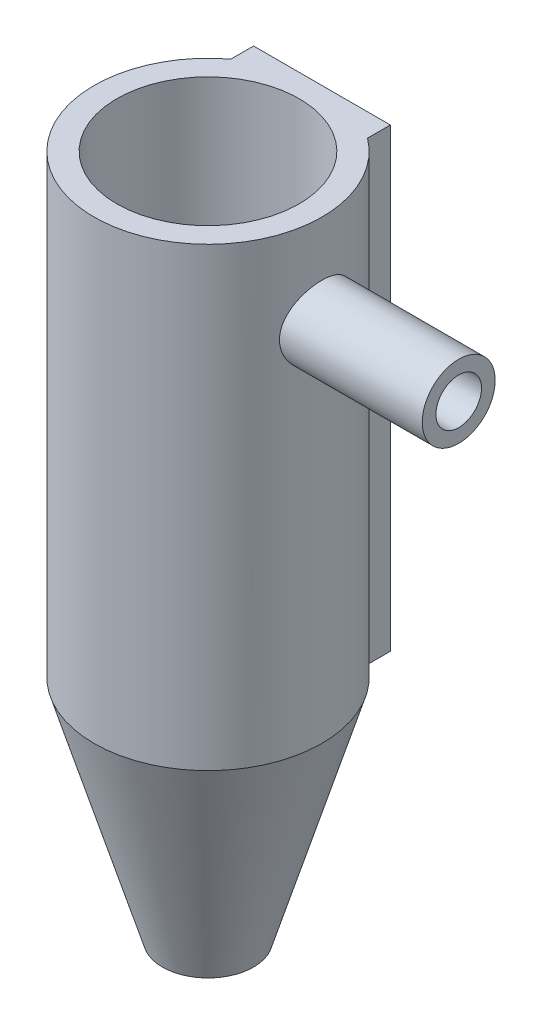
ISO-10303-21;
HEADER;
FILE_DESCRIPTION(('STEP AP214'),'2;1');
FILE_NAME('part.step','',(''),(''),'','','');
FILE_SCHEMA(('AUTOMOTIVE_DESIGN { 1 0 10303 214 1 1 1 1 }'));
ENDSEC;
DATA;
#1=APPLICATION_CONTEXT('core data for automotive mechanical design processes');
#2=APPLICATION_PROTOCOL_DEFINITION('international standard','automotive_design',2000,#1);
#3=PRODUCT_CONTEXT('',#1,'mechanical');
#4=PRODUCT('Part','Part','',(#3));
#5=PRODUCT_RELATED_PRODUCT_CATEGORY('part','',(#4));
#6=PRODUCT_DEFINITION_FORMATION('','',#4);
#7=PRODUCT_DEFINITION_CONTEXT('part definition',#1,'design');
#8=PRODUCT_DEFINITION('design','',#6,#7);
#9=PRODUCT_DEFINITION_SHAPE('','',#8);
#10=(LENGTH_UNIT() NAMED_UNIT(*) SI_UNIT(.MILLI.,.METRE.));
#11=(NAMED_UNIT(*) PLANE_ANGLE_UNIT() SI_UNIT($,.RADIAN.));
#12=(NAMED_UNIT(*) SI_UNIT($,.STERADIAN.) SOLID_ANGLE_UNIT());
#13=UNCERTAINTY_MEASURE_WITH_UNIT(LENGTH_MEASURE(1.E-05),#10,'distance_accuracy_value','');
#14=(GEOMETRIC_REPRESENTATION_CONTEXT(3) GLOBAL_UNCERTAINTY_ASSIGNED_CONTEXT((#13)) GLOBAL_UNIT_ASSIGNED_CONTEXT((#10,
#11,#12)) REPRESENTATION_CONTEXT('',''));
#15=CARTESIAN_POINT('',(0.,0.,0.));
#16=DIRECTION('',(0.,0.,1.));
#17=DIRECTION('',(1.,0.,0.));
#18=AXIS2_PLACEMENT_3D('',#15,#16,#17);
#19=CARTESIAN_POINT('',(0.,150.,0.));
#20=DIRECTION('',(0.,-1.,0.));
#21=DIRECTION('',(0.,0.,-1.));
#22=AXIS2_PLACEMENT_3D('',#19,#20,#21);
#23=CYLINDRICAL_SURFACE('',#22,25.);
#24=CARTESIAN_POINT('',(0.,150.,0.));
#25=DIRECTION('',(0.,1.,0.));
#26=DIRECTION('',(0.,0.,1.));
#27=AXIS2_PLACEMENT_3D('',#24,#25,#26);
#28=CIRCLE('',#27,25.);
#29=CARTESIAN_POINT('',(-15.,150.,-20.));
#30=VERTEX_POINT('',#29);
#31=CARTESIAN_POINT('',(15.,150.,-20.));
#32=VERTEX_POINT('',#31);
#33=EDGE_CURVE('E57',#30,#32,#28,.T.);
#34=ORIENTED_EDGE('',*,*,#33,.F.);
#35=DIRECTION('',(0.,-1.,0.));
#36=VECTOR('',#35,1.);
#37=CARTESIAN_POINT('',(-15.,150.,-20.));
#38=LINE('',#37,#36);
#39=CARTESIAN_POINT('',(-15.,50.,-20.));
#40=VERTEX_POINT('',#39);
#41=EDGE_CURVE('E151',#40,#30,#38,.F.);
#42=ORIENTED_EDGE('',*,*,#41,.F.);
#43=CARTESIAN_POINT('',(0.,50.,0.));
#44=DIRECTION('',(0.,1.,0.));
#45=DIRECTION('',(0.,0.,1.));
#46=AXIS2_PLACEMENT_3D('',#43,#44,#45);
#47=CIRCLE('',#46,25.);
#48=CARTESIAN_POINT('',(15.,50.,-20.));
#49=VERTEX_POINT('',#48);
#50=EDGE_CURVE('E117',#40,#49,#47,.T.);
#51=ORIENTED_EDGE('',*,*,#50,.T.);
#52=DIRECTION('',(0.,-1.,0.));
#53=VECTOR('',#52,1.);
#54=CARTESIAN_POINT('',(15.,150.,-20.));
#55=LINE('',#54,#53);
#56=EDGE_CURVE('E78',#32,#49,#55,.T.);
#57=ORIENTED_EDGE('',*,*,#56,.F.);
#58=EDGE_LOOP('',(#34,#42,#51,#57));
#59=FACE_BOUND('',#58,.T.);
#60=CARTESIAN_POINT('',(23.685438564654,130.,8.));
#61=CARTESIAN_POINT('',(23.6854386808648,129.781580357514,7.99999984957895));
#62=CARTESIAN_POINT('',(23.6884680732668,129.563158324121,7.99104739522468));
#63=CARTESIAN_POINT('',(23.7004886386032,129.127942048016,7.95532466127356));
#64=CARTESIAN_POINT('',(23.7094799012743,128.911147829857,7.92855411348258));
#65=CARTESIAN_POINT('',(23.7331386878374,128.480776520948,7.85745049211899));
#66=CARTESIAN_POINT('',(23.7478062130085,128.267199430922,7.81311741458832));
#67=CARTESIAN_POINT('',(23.7823668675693,127.844696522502,7.70727713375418));
#68=CARTESIAN_POINT('',(23.8022620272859,127.635772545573,7.64576325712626));
#69=CARTESIAN_POINT('',(23.8466255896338,127.224529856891,7.50625010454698));
#70=CARTESIAN_POINT('',(23.8710835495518,127.02219727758,7.42828841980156));
#71=CARTESIAN_POINT('',(23.9238870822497,126.624912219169,7.25642411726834));
#72=CARTESIAN_POINT('',(23.9522341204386,126.429962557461,7.16251548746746));
#73=CARTESIAN_POINT('',(24.0419138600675,125.858146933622,6.85793629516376));
#74=CARTESIAN_POINT('',(24.1079252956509,125.493962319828,6.62429224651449));
#75=CARTESIAN_POINT('',(24.2476140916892,124.797364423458,6.09348517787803));
#76=CARTESIAN_POINT('',(24.3214714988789,124.466378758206,5.7944955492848));
#77=CARTESIAN_POINT('',(24.4305604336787,124.010501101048,5.3080580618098));
#78=CARTESIAN_POINT('',(24.4666614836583,123.86523450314,5.13947531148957));
#79=CARTESIAN_POINT('',(24.5373497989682,123.589123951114,4.79062429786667));
#80=CARTESIAN_POINT('',(24.5719376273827,123.4582746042,4.61036044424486));
#81=CARTESIAN_POINT('',(24.6394882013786,123.208892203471,4.23472797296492));
#82=CARTESIAN_POINT('',(24.6723910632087,123.090735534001,4.03909881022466));
#83=CARTESIAN_POINT('',(24.7347020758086,122.871428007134,3.63808475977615));
#84=CARTESIAN_POINT('',(24.7641115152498,122.770270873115,3.43270350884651));
#85=CARTESIAN_POINT('',(24.8186071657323,122.585754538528,3.01353634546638));
#86=CARTESIAN_POINT('',(24.8436933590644,122.502395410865,2.7997503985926));
#87=CARTESIAN_POINT('',(24.8888108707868,122.354223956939,2.36532685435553));
#88=CARTESIAN_POINT('',(24.9088423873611,122.289410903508,2.14468952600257));
#89=CARTESIAN_POINT('',(24.9427027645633,122.180728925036,1.7054400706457));
#90=CARTESIAN_POINT('',(24.956710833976,122.136251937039,1.4869921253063));
#91=CARTESIAN_POINT('',(24.9790435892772,122.06566052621,1.04686465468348));
#92=CARTESIAN_POINT('',(24.9873684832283,122.039545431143,0.825185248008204));
#93=CARTESIAN_POINT('',(24.9980969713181,122.005933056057,0.380320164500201));
#94=CARTESIAN_POINT('',(25.0005017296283,121.998432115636,0.157134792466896));
#95=CARTESIAN_POINT('',(24.9993242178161,122.002111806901,-0.289063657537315));
#96=CARTESIAN_POINT('',(24.9957420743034,122.013292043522,-0.512076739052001));
#97=CARTESIAN_POINT('',(24.9829322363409,122.053475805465,-0.948121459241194));
#98=CARTESIAN_POINT('',(24.9739148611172,122.08181551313,-1.16122085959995));
#99=CARTESIAN_POINT('',(24.9506525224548,122.155493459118,-1.58424295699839));
#100=CARTESIAN_POINT('',(24.9364058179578,122.200837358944,-1.79416457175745));
#101=CARTESIAN_POINT('',(24.9030628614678,122.308112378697,-2.20925418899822));
#102=CARTESIAN_POINT('',(24.8839681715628,122.370038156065,-2.41442369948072));
#103=CARTESIAN_POINT('',(24.8414105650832,122.509998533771,-2.81880756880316));
#104=CARTESIAN_POINT('',(24.8179460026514,122.588039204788,-3.0180196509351));
#105=CARTESIAN_POINT('',(24.7669381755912,122.760655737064,-3.41154230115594));
#106=CARTESIAN_POINT('',(24.7393486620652,122.855421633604,-3.60576347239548));
#107=CARTESIAN_POINT('',(24.681002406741,123.060150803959,-3.98560664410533));
#108=CARTESIAN_POINT('',(24.6502445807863,123.170119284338,-4.17122566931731));
#109=CARTESIAN_POINT('',(24.5863436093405,123.404471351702,-4.53270352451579));
#110=CARTESIAN_POINT('',(24.5532003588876,123.528855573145,-4.70856192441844));
#111=CARTESIAN_POINT('',(24.4853581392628,123.791230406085,-5.04950040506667));
#112=CARTESIAN_POINT('',(24.4506591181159,123.929221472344,-5.21458012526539));
#113=CARTESIAN_POINT('',(24.3790361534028,124.224294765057,-5.53999615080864));
#114=CARTESIAN_POINT('',(24.3420813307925,124.381948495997,-5.69980789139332));
#115=CARTESIAN_POINT('',(24.2684460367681,124.710101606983,-6.00560235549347));
#116=CARTESIAN_POINT('',(24.2317654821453,124.880596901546,-6.15158944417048));
#117=CARTESIAN_POINT('',(24.1596686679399,125.233509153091,-6.42891535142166));
#118=CARTESIAN_POINT('',(24.1242530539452,125.415932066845,-6.56024676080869));
#119=CARTESIAN_POINT('',(24.055729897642,125.79141433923,-6.80722281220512));
#120=CARTESIAN_POINT('',(24.0226214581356,125.984469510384,-6.92287356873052));
#121=CARTESIAN_POINT('',(23.9592714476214,126.382572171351,-7.13905927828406));
#122=CARTESIAN_POINT('',(23.9290716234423,126.587740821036,-7.23938361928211));
#123=CARTESIAN_POINT('',(23.8729789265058,127.006321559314,-7.42226578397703));
#124=CARTESIAN_POINT('',(23.8470842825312,127.21973021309,-7.50483091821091));
#125=CARTESIAN_POINT('',(23.800429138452,127.653327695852,-7.6515032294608));
#126=CARTESIAN_POINT('',(23.7796681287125,127.873515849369,-7.71561223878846));
#127=CARTESIAN_POINT('',(23.743975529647,128.319030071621,-7.82476399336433));
#128=CARTESIAN_POINT('',(23.7290436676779,128.544355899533,-7.86980763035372));
#129=CARTESIAN_POINT('',(23.7060174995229,128.988840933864,-7.9388917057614));
#130=CARTESIAN_POINT('',(23.697662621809,129.207862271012,-7.96373400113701));
#131=CARTESIAN_POINT('',(23.6870451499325,129.647353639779,-7.99525936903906));
#132=CARTESIAN_POINT('',(23.6847823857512,129.867823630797,-8.00194294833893));
#133=CARTESIAN_POINT('',(23.6864229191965,130.308505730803,-7.99708539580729));
#134=CARTESIAN_POINT('',(23.6903253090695,130.528717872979,-7.98554694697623));
#135=CARTESIAN_POINT('',(23.7041671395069,130.967248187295,-7.94436471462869));
#136=CARTESIAN_POINT('',(23.7141065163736,131.185566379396,-7.91472112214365));
#137=CARTESIAN_POINT('',(23.7393032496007,131.611957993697,-7.83881510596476));
#138=CARTESIAN_POINT('',(23.7543859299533,131.820139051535,-7.7930971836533));
#139=CARTESIAN_POINT('',(23.7894762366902,132.231876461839,-7.68531262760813));
#140=CARTESIAN_POINT('',(23.8094856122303,132.435431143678,-7.62324018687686));
#141=CARTESIAN_POINT('',(23.8538445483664,132.83647951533,-7.48328019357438));
#142=CARTESIAN_POINT('',(23.878193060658,133.033974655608,-7.40539646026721));
#143=CARTESIAN_POINT('',(23.9305644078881,133.421820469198,-7.23436820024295));
#144=CARTESIAN_POINT('',(23.9585886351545,133.612168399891,-7.14121788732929));
#145=CARTESIAN_POINT('',(24.0184175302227,133.990012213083,-6.93737893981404));
#146=CARTESIAN_POINT('',(24.0503091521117,134.177259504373,-6.82625501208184));
#147=CARTESIAN_POINT('',(24.1163102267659,134.541870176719,-6.58928737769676));
#148=CARTESIAN_POINT('',(24.1504204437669,134.719230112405,-6.46343858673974));
#149=CARTESIAN_POINT('',(24.219938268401,135.06297832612,-6.19785668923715));
#150=CARTESIAN_POINT('',(24.2553459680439,135.229365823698,-6.05812259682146));
#151=CARTESIAN_POINT('',(24.3265313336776,135.550188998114,-5.76563306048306));
#152=CARTESIAN_POINT('',(24.3623090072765,135.704624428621,-5.61287734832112));
#153=CARTESIAN_POINT('',(24.4348785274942,136.00714536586,-5.28824824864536));
#154=CARTESIAN_POINT('',(24.4716456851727,136.154652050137,-5.11582929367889));
#155=CARTESIAN_POINT('',(24.5435459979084,136.43459001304,-4.75893573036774));
#156=CARTESIAN_POINT('',(24.5786796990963,136.567026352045,-4.57446520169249));
#157=CARTESIAN_POINT('',(24.6463632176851,136.815979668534,-4.19452275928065));
#158=CARTESIAN_POINT('',(24.6789120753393,136.932490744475,-3.99904680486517));
#159=CARTESIAN_POINT('',(24.7404858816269,137.148592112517,-3.59852554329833));
#160=CARTESIAN_POINT('',(24.7695122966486,137.248189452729,-3.39348426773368));
#161=CARTESIAN_POINT('',(24.8230510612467,137.429083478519,-2.97657551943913));
#162=CARTESIAN_POINT('',(24.8475925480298,137.510499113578,-2.76476344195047));
#163=CARTESIAN_POINT('',(24.8916927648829,137.655136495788,-2.3345989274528));
#164=CARTESIAN_POINT('',(24.9112534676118,137.718365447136,-2.1162491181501));
#165=CARTESIAN_POINT('',(24.9448363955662,137.826077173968,-1.67456921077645));
#166=CARTESIAN_POINT('',(24.9588590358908,137.870561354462,-1.4512394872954));
#167=CARTESIAN_POINT('',(24.9809545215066,137.940351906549,-1.00131466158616));
#168=CARTESIAN_POINT('',(24.9890275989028,137.96565902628,-0.774719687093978));
#169=CARTESIAN_POINT('',(24.9987683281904,137.996162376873,-0.329977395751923));
#170=CARTESIAN_POINT('',(25.0006997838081,138.002186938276,-0.111892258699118));
#171=CARTESIAN_POINT('',(24.9988502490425,137.996406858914,0.324016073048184));
#172=CARTESIAN_POINT('',(24.9950693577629,137.984602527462,0.541839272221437));
#173=CARTESIAN_POINT('',(24.9818989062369,137.943277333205,0.975606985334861));
#174=CARTESIAN_POINT('',(24.9725097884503,137.91375786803,1.19155164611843));
#175=CARTESIAN_POINT('',(24.9483780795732,137.837275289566,1.62002344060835));
#176=CARTESIAN_POINT('',(24.9336354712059,137.790312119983,1.83255056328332));
#177=CARTESIAN_POINT('',(24.8994319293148,137.680130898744,2.24977742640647));
#178=CARTESIAN_POINT('',(24.8800393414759,137.617147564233,2.45454487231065));
#179=CARTESIAN_POINT('',(24.8369245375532,137.475118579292,2.85803478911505));
#180=CARTESIAN_POINT('',(24.8132008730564,137.396067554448,3.05675521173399));
#181=CARTESIAN_POINT('',(24.7620297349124,137.222533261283,3.44682151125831));
#182=CARTESIAN_POINT('',(24.7345824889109,137.128050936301,3.63816783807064));
#183=CARTESIAN_POINT('',(24.6766448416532,136.924329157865,4.01236245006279));
#184=CARTESIAN_POINT('',(24.6461542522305,136.815088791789,4.19521020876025));
#185=CARTESIAN_POINT('',(24.5817710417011,136.57851579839,4.5575842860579));
#186=CARTESIAN_POINT('',(24.5477966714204,136.450683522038,4.73676999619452));
#187=CARTESIAN_POINT('',(24.4782780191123,136.180864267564,5.08382063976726));
#188=CARTESIAN_POINT('',(24.4427337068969,136.038877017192,5.25168535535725));
#189=CARTESIAN_POINT('',(24.3709920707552,135.741607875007,5.57514131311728));
#190=CARTESIAN_POINT('',(24.3347945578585,135.586322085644,5.73072893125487));
#191=CARTESIAN_POINT('',(24.2627094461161,135.263442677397,6.02863349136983));
#192=CARTESIAN_POINT('',(24.2268218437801,135.095849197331,6.17095058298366));
#193=CARTESIAN_POINT('',(24.1550622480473,134.743192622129,6.44623280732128));
#194=CARTESIAN_POINT('',(24.1192360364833,134.557720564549,6.57868658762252));
#195=CARTESIAN_POINT('',(24.0500083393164,134.175898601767,6.82742754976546));
#196=CARTESIAN_POINT('',(24.0166060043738,133.979552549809,6.94372040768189));
#197=CARTESIAN_POINT('',(23.9532271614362,133.577225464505,7.15929721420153));
#198=CARTESIAN_POINT('',(23.9232503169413,133.371245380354,7.25858283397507));
#199=CARTESIAN_POINT('',(23.8676625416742,132.951044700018,7.43933021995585));
#200=CARTESIAN_POINT('',(23.8420512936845,132.736824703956,7.52079328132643));
#201=CARTESIAN_POINT('',(23.7976656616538,132.317170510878,7.66003007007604));
#202=CARTESIAN_POINT('',(23.7785344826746,132.112195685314,7.71907691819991));
#203=CARTESIAN_POINT('',(23.7453132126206,131.697804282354,7.82067534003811));
#204=CARTESIAN_POINT('',(23.7312227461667,131.488388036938,7.86322814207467));
#205=CARTESIAN_POINT('',(23.7085058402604,131.066577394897,7.93145930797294));
#206=CARTESIAN_POINT('',(23.6998781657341,130.85418368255,7.95714148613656));
#207=CARTESIAN_POINT('',(23.6883444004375,130.427860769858,7.99141211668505));
#208=CARTESIAN_POINT('',(23.6854384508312,130.213931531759,8.00000014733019));
#209=CARTESIAN_POINT('',(23.685438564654,130.,8.));
#210=B_SPLINE_CURVE_WITH_KNOTS('',3,(#60,#61,#62,#63,#64,#65,#66,#67,#68,#69,#70,#71,#72,#73,
#74,#75,#76,#77,#78,#79,#80,#81,#82,#83,#84,#85,#86,#87,#88,#89,#90,#91,#92,#93,#94,#95,#96,#97,
#98,#99,#100,#101,#102,#103,#104,#105,#106,#107,#108,#109,#110,#111,#112,#113,#114,#115,#116,
#117,#118,#119,#120,#121,#122,#123,#124,#125,#126,#127,#128,#129,#130,#131,#132,#133,#134,#135,
#136,#137,#138,#139,#140,#141,#142,#143,#144,#145,#146,#147,#148,#149,#150,#151,#152,#153,#154,
#155,#156,#157,#158,#159,#160,#161,#162,#163,#164,#165,#166,#167,#168,#169,#170,#171,#172,#173,
#174,#175,#176,#177,#178,#179,#180,#181,#182,#183,#184,#185,#186,#187,#188,#189,#190,#191,#192,
#193,#194,#195,#196,#197,#198,#199,#200,#201,#202,#203,#204,#205,#206,#207,#208,#209),
.UNSPECIFIED.,.T.,.F.,(4,2,2,2,2,2,2,2,2,2,2,2,2,2,2,2,2,2,2,2,2,2,2,2,2,2,2,2,2,2,2,2,2,2,2,2,
2,2,2,2,2,2,2,2,2,2,2,2,2,2,2,2,2,2,2,2,2,2,2,2,2,2,2,2,2,2,2,2,2,2,2,2,2,2,4),(0.,
0.655059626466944,1.31012911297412,1.96519874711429,2.6205231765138,3.27436579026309,
3.92845545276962,5.23552596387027,6.58532065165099,7.26102103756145,7.93646781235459,
8.62832191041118,9.31991999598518,10.0115209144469,10.7030947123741,11.3723642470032,
12.0416092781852,12.7107226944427,13.379821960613,14.0245575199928,14.6695079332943,
15.3142507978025,15.9592369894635,16.6120885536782,17.2651642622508,17.9182687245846,
18.5713950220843,19.253131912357,19.9346528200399,20.6165167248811,21.2981139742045,
21.9883670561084,22.6783354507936,23.3682353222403,24.0581029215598,24.7190289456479,
25.379936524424,26.0407468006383,26.7015501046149,27.3418387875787,27.9823551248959,
28.6227169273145,29.2633219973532,29.9227705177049,30.5824474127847,31.2421711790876,
31.9019085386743,32.5906888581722,33.279237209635,33.9680400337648,34.6565551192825,
35.3404244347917,36.0240224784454,36.7075692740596,37.391089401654,38.0448231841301,
38.6985456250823,39.3522164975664,40.0058894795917,40.6504875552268,41.2953015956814,
41.9400762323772,42.5848907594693,43.2522885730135,43.9196992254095,44.5873061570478,
45.254905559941,45.9462048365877,46.6372606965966,47.3282486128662,48.0191862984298,
48.6609628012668,49.3026915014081,49.944275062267,50.5858744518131),.UNSPECIFIED.);
#211=CARTESIAN_POINT('',(23.685438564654,130.,8.));
#212=VERTEX_POINT('',#211);
#213=EDGE_CURVE('E12',#212,#212,#210,.T.);
#214=ORIENTED_EDGE('',*,*,#213,.F.);
#215=EDGE_LOOP('',(#214));
#216=FACE_BOUND('',#215,.T.);
#217=ADVANCED_FACE('F36',(#59,#216),#23,.T.);
#218=CARTESIAN_POINT('',(0.,150.,0.));
#219=DIRECTION('',(0.,-1.,0.));
#220=DIRECTION('',(0.,0.,-1.));
#221=AXIS2_PLACEMENT_3D('',#218,#219,#220);
#222=CYLINDRICAL_SURFACE('',#221,20.);
#223=CARTESIAN_POINT('',(0.,50.7338441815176,0.));
#224=DIRECTION('',(0.,1.,0.));
#225=DIRECTION('',(0.,0.,1.));
#226=AXIS2_PLACEMENT_3D('',#223,#224,#225);
#227=CIRCLE('',#226,20.);
#228=CARTESIAN_POINT('',(0.,50.7338441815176,20.));
#229=VERTEX_POINT('',#228);
#230=EDGE_CURVE('E107',#229,#229,#227,.T.);
#231=ORIENTED_EDGE('',*,*,#230,.F.);
#232=EDGE_LOOP('',(#231));
#233=FACE_BOUND('',#232,.T.);
#234=CARTESIAN_POINT('',(0.,150.,0.));
#235=DIRECTION('',(0.,1.,0.));
#236=DIRECTION('',(0.,0.,1.));
#237=AXIS2_PLACEMENT_3D('',#234,#235,#236);
#238=CIRCLE('',#237,20.);
#239=CARTESIAN_POINT('',(0.,150.,20.));
#240=VERTEX_POINT('',#239);
#241=EDGE_CURVE('E111',#240,#240,#238,.T.);
#242=ORIENTED_EDGE('',*,*,#241,.T.);
#243=EDGE_LOOP('',(#242));
#244=FACE_BOUND('',#243,.T.);
#245=CARTESIAN_POINT('',(19.3649167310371,130.,5.));
#246=CARTESIAN_POINT('',(19.3649220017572,129.723898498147,4.99999215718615));
#247=CARTESIAN_POINT('',(19.3708861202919,129.447710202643,4.97705249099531));
#248=CARTESIAN_POINT('',(19.3940372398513,128.903264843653,4.88604625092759));
#249=CARTESIAN_POINT('',(19.4112307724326,128.635012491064,4.81795341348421));
#250=CARTESIAN_POINT('',(19.454774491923,128.114392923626,4.63898239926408));
#251=CARTESIAN_POINT('',(19.4811128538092,127.862005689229,4.52815945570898));
#252=CARTESIAN_POINT('',(19.5399638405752,127.37937829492,4.26704228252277));
#253=CARTESIAN_POINT('',(19.5724767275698,127.14913907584,4.11674637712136));
#254=CARTESIAN_POINT('',(19.6408143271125,126.712276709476,3.77741685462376));
#255=CARTESIAN_POINT('',(19.6766919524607,126.5062127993,3.5876737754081));
#256=CARTESIAN_POINT('',(19.7472575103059,126.128477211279,3.17636412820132));
#257=CARTESIAN_POINT('',(19.7819453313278,125.956808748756,2.95479458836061));
#258=CARTESIAN_POINT('',(19.8468083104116,125.650449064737,2.48229040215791));
#259=CARTESIAN_POINT('',(19.8769137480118,125.516307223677,2.23098915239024));
#260=CARTESIAN_POINT('',(19.9286162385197,125.292380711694,1.70852636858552));
#261=CARTESIAN_POINT('',(19.9502145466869,125.202589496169,1.43736777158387));
#262=CARTESIAN_POINT('',(19.9820951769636,125.071704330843,0.888717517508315));
#263=CARTESIAN_POINT('',(19.9925978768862,125.029660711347,0.611465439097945));
#264=CARTESIAN_POINT('',(20.001871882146,124.992483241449,0.0536576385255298));
#265=CARTESIAN_POINT('',(20.0006449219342,124.997342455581,-0.22689758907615));
#266=CARTESIAN_POINT('',(19.9867618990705,125.0531497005,-0.776761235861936));
#267=CARTESIAN_POINT('',(19.9743600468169,125.103072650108,-1.04618107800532));
#268=CARTESIAN_POINT('',(19.9398167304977,125.245942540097,-1.57269123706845));
#269=CARTESIAN_POINT('',(19.917674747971,125.338891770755,-1.82978089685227));
#270=CARTESIAN_POINT('',(19.8657501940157,125.566005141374,-2.32703351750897));
#271=CARTESIAN_POINT('',(19.8359003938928,125.700534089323,-2.56702254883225));
#272=CARTESIAN_POINT('',(19.7717980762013,126.006711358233,-3.02137811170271));
#273=CARTESIAN_POINT('',(19.7375447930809,126.178366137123,-3.23574017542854));
#274=CARTESIAN_POINT('',(19.6672742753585,126.559417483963,-3.63887017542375));
#275=CARTESIAN_POINT('',(19.6312343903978,126.769709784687,-3.82678839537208));
#276=CARTESIAN_POINT('',(19.5623008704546,127.219199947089,-4.16488187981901));
#277=CARTESIAN_POINT('',(19.5294073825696,127.458399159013,-4.31505538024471));
#278=CARTESIAN_POINT('',(19.4704099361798,127.960580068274,-4.57394064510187));
#279=CARTESIAN_POINT('',(19.4443396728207,128.223671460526,-4.68244783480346));
#280=CARTESIAN_POINT('',(19.4023728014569,128.76517093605,-4.85342810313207));
#281=CARTESIAN_POINT('',(19.3864740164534,129.043575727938,-4.91591103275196));
#282=CARTESIAN_POINT('',(19.3671071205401,129.599919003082,-4.99165927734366));
#283=CARTESIAN_POINT('',(19.3633217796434,129.877675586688,-5.00618094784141));
#284=CARTESIAN_POINT('',(19.3677468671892,130.431643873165,-4.98903398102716));
#285=CARTESIAN_POINT('',(19.3759561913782,130.707855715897,-4.95736959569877));
#286=CARTESIAN_POINT('',(19.403141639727,131.246228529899,-4.84985092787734));
#287=CARTESIAN_POINT('',(19.421939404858,131.508545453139,-4.77472813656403));
#288=CARTESIAN_POINT('',(19.4680143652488,132.016862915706,-4.58323616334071));
#289=CARTESIAN_POINT('',(19.4952925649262,132.262861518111,-4.46686209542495));
#290=CARTESIAN_POINT('',(19.5559227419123,132.736882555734,-4.19354133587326));
#291=CARTESIAN_POINT('',(19.5893833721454,132.964457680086,-4.03584350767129));
#292=CARTESIAN_POINT('',(19.6583416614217,133.390376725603,-3.68530146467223));
#293=CARTESIAN_POINT('',(19.693839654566,133.5887158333,-3.49245147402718));
#294=CARTESIAN_POINT('',(19.7639480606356,133.955622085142,-3.07131360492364));
#295=CARTESIAN_POINT('',(19.7985140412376,134.123320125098,-2.84225976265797));
#296=CARTESIAN_POINT('',(19.8619443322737,134.417871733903,-2.35851341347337));
#297=CARTESIAN_POINT('',(19.890808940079,134.544727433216,-2.10382224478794));
#298=CARTESIAN_POINT('',(19.9394023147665,134.752892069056,-1.57779100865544));
#299=CARTESIAN_POINT('',(19.9591966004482,134.834528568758,-1.30658690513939));
#300=CARTESIAN_POINT('',(19.9877058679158,134.950920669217,-0.753748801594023));
#301=CARTESIAN_POINT('',(19.9964229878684,134.985685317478,-0.472116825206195));
#302=CARTESIAN_POINT('',(20.0017084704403,135.006837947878,0.085417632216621));
#303=CARTESIAN_POINT('',(19.9985989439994,134.994508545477,0.361269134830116));
#304=CARTESIAN_POINT('',(19.9812948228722,134.924760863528,0.906837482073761));
#305=CARTESIAN_POINT('',(19.9671005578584,134.867343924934,1.17655450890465));
#306=CARTESIAN_POINT('',(19.9292716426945,134.709738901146,1.70085517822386));
#307=CARTESIAN_POINT('',(19.9056882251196,134.609782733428,1.9555124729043));
#308=CARTESIAN_POINT('',(19.8515644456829,134.370147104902,2.44458526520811));
#309=CARTESIAN_POINT('',(19.8210232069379,134.230462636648,2.67899820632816));
#310=CARTESIAN_POINT('',(19.7553624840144,133.911423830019,3.12700964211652));
#311=CARTESIAN_POINT('',(19.7201508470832,133.731199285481,3.33997494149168));
#312=CARTESIAN_POINT('',(19.6495324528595,133.337885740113,3.73307510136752));
#313=CARTESIAN_POINT('',(19.6141256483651,133.124788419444,3.91320162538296));
#314=CARTESIAN_POINT('',(19.5463737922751,132.666992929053,4.23881013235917));
#315=CARTESIAN_POINT('',(19.5140981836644,132.421779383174,4.3835830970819));
#316=CARTESIAN_POINT('',(19.4571977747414,131.909722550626,4.62963448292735));
#317=CARTESIAN_POINT('',(19.4325674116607,131.642895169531,4.73094454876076));
#318=CARTESIAN_POINT('',(19.3975954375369,131.147114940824,4.87211264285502));
#319=CARTESIAN_POINT('',(19.3854331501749,130.920534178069,4.91996585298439));
#320=CARTESIAN_POINT('',(19.369091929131,130.462655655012,4.98391146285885));
#321=CARTESIAN_POINT('',(19.3649123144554,130.231358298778,5.00000657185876));
#322=CARTESIAN_POINT('',(19.3649167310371,130.,5.));
#323=B_SPLINE_CURVE_WITH_KNOTS('',3,(#245,#246,#247,#248,#249,#250,#251,#252,#253,#254,#255,
#256,#257,#258,#259,#260,#261,#262,#263,#264,#265,#266,#267,#268,#269,#270,#271,#272,#273,#274,
#275,#276,#277,#278,#279,#280,#281,#282,#283,#284,#285,#286,#287,#288,#289,#290,#291,#292,#293,
#294,#295,#296,#297,#298,#299,#300,#301,#302,#303,#304,#305,#306,#307,#308,#309,#310,#311,#312,
#313,#314,#315,#316,#317,#318,#319,#320,#321,#322),.UNSPECIFIED.,.T.,.F.,(4,2,2,2,2,2,2,2,2,2,2,
2,2,2,2,2,2,2,2,2,2,2,2,2,2,2,2,2,2,2,2,2,2,2,2,2,2,2,4),(0.,0.82745488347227,1.65539148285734,
2.48226145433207,3.30916653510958,4.15247908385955,4.99587042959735,5.85102992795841,
6.70606319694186,7.54377501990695,8.38136297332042,9.20036525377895,10.0194111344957,
10.8458574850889,11.6724477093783,12.5214093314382,13.370410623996,14.2235286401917,
15.0764640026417,15.9068714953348,16.7372025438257,17.5539481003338,18.370790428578,
19.2036569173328,20.0366603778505,20.890506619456,21.7443083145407,22.5918414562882,
23.4392109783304,24.2636689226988,25.0881023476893,25.9080975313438,26.7281961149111,
27.5679419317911,28.4079006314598,29.2635295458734,30.118534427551,30.8119565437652,
31.5053195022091),.UNSPECIFIED.);
#324=CARTESIAN_POINT('',(19.3649167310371,130.,5.));
#325=VERTEX_POINT('',#324);
#326=EDGE_CURVE('E82',#325,#325,#323,.T.);
#327=ORIENTED_EDGE('',*,*,#326,.T.);
#328=EDGE_LOOP('',(#327));
#329=FACE_BOUND('',#328,.T.);
#330=ADVANCED_FACE('F186',(#233,#244,#329),#222,.F.);
#331=CARTESIAN_POINT('',(0.,0.,0.));
#332=DIRECTION('',(0.,1.,0.));
#333=DIRECTION('',(0.,0.,1.));
#334=AXIS2_PLACEMENT_3D('',#331,#332,#333);
#335=PLANE('',#334);
#336=CARTESIAN_POINT('',(0.,0.,0.));
#337=DIRECTION('',(0.,1.,0.));
#338=DIRECTION('',(0.,0.,1.));
#339=AXIS2_PLACEMENT_3D('',#336,#337,#338);
#340=CIRCLE('',#339,4.77984674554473);
#341=CARTESIAN_POINT('',(0.,0.,4.77984674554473));
#342=VERTEX_POINT('',#341);
#343=EDGE_CURVE('E110',#342,#342,#340,.T.);
#344=ORIENTED_EDGE('',*,*,#343,.T.);
#345=EDGE_LOOP('',(#344));
#346=FACE_BOUND('',#345,.T.);
#347=CARTESIAN_POINT('',(0.,0.,0.));
#348=DIRECTION('',(0.,1.,0.));
#349=DIRECTION('',(0.,0.,1.));
#350=AXIS2_PLACEMENT_3D('',#347,#348,#349);
#351=CIRCLE('',#350,10.);
#352=CARTESIAN_POINT('',(0.,0.,10.));
#353=VERTEX_POINT('',#352);
#354=EDGE_CURVE('E50',#353,#353,#351,.T.);
#355=ORIENTED_EDGE('',*,*,#354,.F.);
#356=EDGE_LOOP('',(#355));
#357=FACE_BOUND('',#356,.T.);
#358=ADVANCED_FACE('F211',(#346,#357),#335,.F.);
#359=CARTESIAN_POINT('',(0.,0.,0.));
#360=DIRECTION('',(0.,1.,0.));
#361=DIRECTION('',(0.,0.,1.));
#362=AXIS2_PLACEMENT_3D('',#359,#360,#361);
#363=CONICAL_SURFACE('',#362,10.,0.291456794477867);
#364=ORIENTED_EDGE('',*,*,#354,.T.);
#365=EDGE_LOOP('',(#364));
#366=FACE_BOUND('',#365,.T.);
#367=CARTESIAN_POINT('',(0.,50.,-25.));
#368=VERTEX_POINT('',#367);
#369=EDGE_CURVE('E88',#49,#368,#47,.T.);
#370=ORIENTED_EDGE('',*,*,#369,.F.);
#371=ORIENTED_EDGE('',*,*,#50,.F.);
#372=CARTESIAN_POINT('',(0.,50.,0.));
#373=DIRECTION('',(0.,-1.,0.));
#374=DIRECTION('',(0.,0.,-1.));
#375=AXIS2_PLACEMENT_3D('',#372,#373,#374);
#376=CIRCLE('',#375,25.);
#377=EDGE_CURVE('E159',#368,#40,#376,.F.);
#378=ORIENTED_EDGE('',*,*,#377,.F.);
#379=EDGE_LOOP('',(#370,#371,#378));
#380=FACE_BOUND('',#379,.T.);
#381=ADVANCED_FACE('F38',(#366,#380),#363,.T.);
#382=CARTESIAN_POINT('',(0.,150.,0.));
#383=DIRECTION('',(0.,1.,0.));
#384=DIRECTION('',(0.,0.,1.));
#385=AXIS2_PLACEMENT_3D('',#382,#383,#384);
#386=PLANE('',#385);
#387=ORIENTED_EDGE('',*,*,#241,.F.);
#388=EDGE_LOOP('',(#387));
#389=FACE_BOUND('',#388,.T.);
#390=DIRECTION('',(1.,0.,0.));
#391=VECTOR('',#390,1.);
#392=CARTESIAN_POINT('',(15.,150.,-25.));
#393=LINE('',#392,#391);
#394=CARTESIAN_POINT('',(-15.,150.,-25.));
#395=VERTEX_POINT('',#394);
#396=CARTESIAN_POINT('',(15.,150.,-25.));
#397=VERTEX_POINT('',#396);
#398=EDGE_CURVE('E92',#395,#397,#393,.T.);
#399=ORIENTED_EDGE('',*,*,#398,.F.);
#400=DIRECTION('',(0.,0.,-1.));
#401=VECTOR('',#400,1.);
#402=CARTESIAN_POINT('',(-15.,150.,25.4814679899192));
#403=LINE('',#402,#401);
#404=EDGE_CURVE('E93',#30,#395,#403,.T.);
#405=ORIENTED_EDGE('',*,*,#404,.F.);
#406=ORIENTED_EDGE('',*,*,#33,.T.);
#407=DIRECTION('',(0.,0.,-1.));
#408=VECTOR('',#407,1.);
#409=CARTESIAN_POINT('',(15.,150.,25.4814679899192));
#410=LINE('',#409,#408);
#411=EDGE_CURVE('E99',#32,#397,#410,.T.);
#412=ORIENTED_EDGE('',*,*,#411,.T.);
#413=EDGE_LOOP('',(#399,#405,#406,#412));
#414=FACE_BOUND('',#413,.T.);
#415=ADVANCED_FACE('F198',(#389,#414),#386,.T.);
#416=CARTESIAN_POINT('',(0.,1.43673942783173,0.));
#417=DIRECTION('',(0.,1.,0.));
#418=DIRECTION('',(0.,0.,1.));
#419=AXIS2_PLACEMENT_3D('',#416,#417,#418);
#420=CONICAL_SURFACE('',#419,5.21086857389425,0.291456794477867);
#421=CARTESIAN_POINT('',(0.,0.,4.77984674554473));
#422=CARTESIAN_POINT('',(0.,0.528477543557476,4.93839000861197));
#423=CARTESIAN_POINT('',(0.,1.05695508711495,5.09693327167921));
#424=CARTESIAN_POINT('',(0.,2.1139101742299,5.4140197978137));
#425=CARTESIAN_POINT('',(0.,2.64238771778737,5.57256306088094));
#426=CARTESIAN_POINT('',(0.,3.69934280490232,5.88964958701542));
#427=CARTESIAN_POINT('',(0.,4.2278203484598,6.04819285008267));
#428=CARTESIAN_POINT('',(0.,5.28477543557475,6.36527937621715));
#429=CARTESIAN_POINT('',(0.,5.81325297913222,6.52382263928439));
#430=CARTESIAN_POINT('',(0.,6.87020806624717,6.84090916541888));
#431=CARTESIAN_POINT('',(0.,7.39868560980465,6.99945242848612));
#432=CARTESIAN_POINT('',(0.,8.4556406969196,7.31653895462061));
#433=CARTESIAN_POINT('',(0.,8.98411824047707,7.47508221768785));
#434=CARTESIAN_POINT('',(0.,10.041073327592,7.79216874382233));
#435=CARTESIAN_POINT('',(0.,10.5695508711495,7.95071200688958));
#436=CARTESIAN_POINT('',(0.,11.6265059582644,8.26779853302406));
#437=CARTESIAN_POINT('',(0.,12.1549835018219,8.4263417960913));
#438=CARTESIAN_POINT('',(0.,13.2119385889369,8.74342832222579));
#439=CARTESIAN_POINT('',(0.,13.7404161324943,8.90197158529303));
#440=CARTESIAN_POINT('',(0.,14.7973712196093,9.21905811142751));
#441=CARTESIAN_POINT('',(0.,15.3258487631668,9.37760137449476));
#442=CARTESIAN_POINT('',(0.,16.3828038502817,9.69468790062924));
#443=CARTESIAN_POINT('',(0.,16.9112813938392,9.85323116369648));
#444=CARTESIAN_POINT('',(0.,17.9682364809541,10.170317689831));
#445=CARTESIAN_POINT('',(0.,18.4967140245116,10.3288609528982));
#446=CARTESIAN_POINT('',(0.,19.5536691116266,10.6459474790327));
#447=CARTESIAN_POINT('',(0.,20.082146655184,10.8044907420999));
#448=CARTESIAN_POINT('',(0.,21.139101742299,11.1215772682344));
#449=CARTESIAN_POINT('',(0.,21.6675792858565,11.2801205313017));
#450=CARTESIAN_POINT('',(0.,22.7245343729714,11.5972070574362));
#451=CARTESIAN_POINT('',(0.,23.2530119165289,11.7557503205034));
#452=CARTESIAN_POINT('',(0.,24.3099670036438,12.0728368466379));
#453=CARTESIAN_POINT('',(0.,24.8384445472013,12.2313801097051));
#454=CARTESIAN_POINT('',(0.,25.8953996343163,12.5484666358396));
#455=CARTESIAN_POINT('',(0.,26.4238771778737,12.7070098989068));
#456=CARTESIAN_POINT('',(0.,27.4808322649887,13.0240964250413));
#457=CARTESIAN_POINT('',(0.,28.0093098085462,13.1826396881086));
#458=CARTESIAN_POINT('',(0.,29.0662648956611,13.4997262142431));
#459=CARTESIAN_POINT('',(0.,29.5947424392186,13.6582694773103));
#460=CARTESIAN_POINT('',(0.,30.6516975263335,13.9753560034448));
#461=CARTESIAN_POINT('',(0.,31.180175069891,14.133899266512));
#462=CARTESIAN_POINT('',(0.,32.237130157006,14.4509857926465));
#463=CARTESIAN_POINT('',(0.,32.7656077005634,14.6095290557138));
#464=CARTESIAN_POINT('',(0.,33.8225627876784,14.9266155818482));
#465=CARTESIAN_POINT('',(0.,34.3510403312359,15.0851588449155));
#466=CARTESIAN_POINT('',(0.,35.4079954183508,15.40224537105));
#467=CARTESIAN_POINT('',(0.,35.9364729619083,15.5607886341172));
#468=CARTESIAN_POINT('',(0.,36.9934280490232,15.8778751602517));
#469=CARTESIAN_POINT('',(0.,37.5219055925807,16.0364184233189));
#470=CARTESIAN_POINT('',(0.,38.5788606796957,16.3535049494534));
#471=CARTESIAN_POINT('',(0.,39.1073382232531,16.5120482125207));
#472=CARTESIAN_POINT('',(0.,40.1642933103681,16.8291347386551));
#473=CARTESIAN_POINT('',(0.,40.6927708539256,16.9876780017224));
#474=CARTESIAN_POINT('',(0.,41.7497259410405,17.3047645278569));
#475=CARTESIAN_POINT('',(0.,42.278203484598,17.4633077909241));
#476=CARTESIAN_POINT('',(0.,43.3351585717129,17.7803943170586));
#477=CARTESIAN_POINT('',(0.,43.8636361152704,17.9389375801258));
#478=CARTESIAN_POINT('',(0.,44.9205912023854,18.2560241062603));
#479=CARTESIAN_POINT('',(0.,45.4490687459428,18.4145673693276));
#480=CARTESIAN_POINT('',(0.,46.5060238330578,18.7316538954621));
#481=CARTESIAN_POINT('',(0.,47.0345013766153,18.8901971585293));
#482=CARTESIAN_POINT('',(0.,48.0914564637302,19.2072836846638));
#483=CARTESIAN_POINT('',(0.,48.6199340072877,19.365826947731));
#484=CARTESIAN_POINT('',(0.,49.6768890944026,19.6829134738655));
#485=CARTESIAN_POINT('',(0.,50.2053666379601,19.8414567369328));
#486=CARTESIAN_POINT('',(0.,50.7338441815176,20.));
#487=B_SPLINE_CURVE_WITH_KNOTS('',3,(#421,#422,#423,#424,#425,#426,#427,#428,#429,#430,#431,
#432,#433,#434,#435,#436,#437,#438,#439,#440,#441,#442,#443,#444,#445,#446,#447,#448,#449,#450,
#451,#452,#453,#454,#455,#456,#457,#458,#459,#460,#461,#462,#463,#464,#465,#466,#467,#468,#469,
#470,#471,#472,#473,#474,#475,#476,#477,#478,#479,#480,#481,#482,#483,#484,#485,#486),
.UNSPECIFIED.,.F.,.F.,(4,2,2,2,2,2,2,2,2,2,2,2,2,2,2,2,2,2,2,2,2,2,2,2,2,2,2,2,2,2,2,2,4),(0.,
1.65524026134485,3.3104805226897,4.96572078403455,6.6209610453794,8.27620130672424,
9.9314415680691,11.5866818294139,13.2419220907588,14.8971623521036,16.5524026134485,
18.2076428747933,19.8628831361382,21.518123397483,23.1733636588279,24.8286039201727,
26.4838441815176,28.1390844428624,29.7943247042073,31.4495649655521,33.104805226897,
34.7600454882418,36.4152857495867,38.0705260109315,39.7257662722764,41.3810065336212,
43.0362467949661,44.6914870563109,46.3467273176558,48.0019675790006,49.6572078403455,
51.3124481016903,52.9676883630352),.UNSPECIFIED.);
#488=EDGE_CURVE('BSEAM194',#342,#229,#487,.T.);
#489=ORIENTED_EDGE('',*,*,#343,.F.);
#490=ORIENTED_EDGE('',*,*,#230,.T.);
#491=ORIENTED_EDGE('',*,*,#488,.T.);
#492=ORIENTED_EDGE('',*,*,#488,.F.);
#493=EDGE_LOOP('',(#489,#491,#490,#492));
#494=FACE_BOUND('',#493,.T.);
#495=ADVANCED_FACE('F194',(#494),#420,.F.);
#496=CARTESIAN_POINT('',(25.4804679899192,130.,0.));
#497=DIRECTION('',(-1.,0.,0.));
#498=DIRECTION('',(0.,0.,1.));
#499=AXIS2_PLACEMENT_3D('',#496,#497,#498);
#500=CYLINDRICAL_SURFACE('',#499,5.);
#501=ORIENTED_EDGE('',*,*,#326,.F.);
#502=EDGE_LOOP('',(#501));
#503=FACE_BOUND('',#502,.T.);
#504=CARTESIAN_POINT('',(55.,130.,0.));
#505=DIRECTION('',(1.,0.,0.));
#506=DIRECTION('',(0.,0.,-1.));
#507=AXIS2_PLACEMENT_3D('',#504,#505,#506);
#508=CIRCLE('',#507,5.);
#509=CARTESIAN_POINT('',(55.,130.,-5.));
#510=VERTEX_POINT('',#509);
#511=EDGE_CURVE('E249',#510,#510,#508,.T.);
#512=ORIENTED_EDGE('',*,*,#511,.T.);
#513=EDGE_LOOP('',(#512));
#514=FACE_BOUND('',#513,.T.);
#515=ADVANCED_FACE('F190',(#503,#514),#500,.F.);
#516=CARTESIAN_POINT('',(0.,0.,-25.));
#517=DIRECTION('',(0.,0.,-1.));
#518=DIRECTION('',(-1.,0.,0.));
#519=AXIS2_PLACEMENT_3D('',#516,#517,#518);
#520=PLANE('',#519);
#521=DIRECTION('',(-1.,0.,0.));
#522=VECTOR('',#521,1.);
#523=CARTESIAN_POINT('',(15.,50.,-25.));
#524=LINE('',#523,#522);
#525=CARTESIAN_POINT('',(15.,50.,-25.));
#526=VERTEX_POINT('',#525);
#527=EDGE_CURVE('E85',#526,#368,#524,.T.);
#528=ORIENTED_EDGE('',*,*,#527,.T.);
#529=DIRECTION('',(-1.,0.,0.));
#530=VECTOR('',#529,1.);
#531=CARTESIAN_POINT('',(15.,50.,-25.));
#532=LINE('',#531,#530);
#533=CARTESIAN_POINT('',(-15.,50.,-25.));
#534=VERTEX_POINT('',#533);
#535=EDGE_CURVE('E146',#368,#534,#532,.T.);
#536=ORIENTED_EDGE('',*,*,#535,.T.);
#537=DIRECTION('',(0.,1.,0.));
#538=VECTOR('',#537,1.);
#539=CARTESIAN_POINT('',(-15.,150.,-25.));
#540=LINE('',#539,#538);
#541=EDGE_CURVE('E104',#534,#395,#540,.T.);
#542=ORIENTED_EDGE('',*,*,#541,.T.);
#543=ORIENTED_EDGE('',*,*,#398,.T.);
#544=DIRECTION('',(0.,-1.,0.));
#545=VECTOR('',#544,1.);
#546=CARTESIAN_POINT('',(15.,150.,-25.));
#547=LINE('',#546,#545);
#548=EDGE_CURVE('E76',#397,#526,#547,.T.);
#549=ORIENTED_EDGE('',*,*,#548,.T.);
#550=EDGE_LOOP('',(#528,#536,#542,#543,#549));
#551=FACE_BOUND('',#550,.T.);
#552=ADVANCED_FACE('F96',(#551),#520,.T.);
#553=CARTESIAN_POINT('',(15.,50.,25.4814679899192));
#554=DIRECTION('',(0.,-1.,0.));
#555=DIRECTION('',(0.,0.,-1.));
#556=AXIS2_PLACEMENT_3D('',#553,#554,#555);
#557=PLANE('',#556);
#558=DIRECTION('',(0.,0.,-1.));
#559=VECTOR('',#558,1.);
#560=CARTESIAN_POINT('',(15.,50.,25.4814679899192));
#561=LINE('',#560,#559);
#562=EDGE_CURVE('E72',#49,#526,#561,.T.);
#563=ORIENTED_EDGE('',*,*,#562,.F.);
#564=ORIENTED_EDGE('',*,*,#369,.T.);
#565=ORIENTED_EDGE('',*,*,#527,.F.);
#566=EDGE_LOOP('',(#563,#564,#565));
#567=FACE_BOUND('',#566,.T.);
#568=ADVANCED_FACE('F86',(#567),#557,.T.);
#569=CARTESIAN_POINT('',(15.,150.,25.4814679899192));
#570=DIRECTION('',(1.,0.,0.));
#571=DIRECTION('',(0.,1.,0.));
#572=AXIS2_PLACEMENT_3D('',#569,#570,#571);
#573=PLANE('',#572);
#574=ORIENTED_EDGE('',*,*,#411,.F.);
#575=ORIENTED_EDGE('',*,*,#56,.T.);
#576=ORIENTED_EDGE('',*,*,#562,.T.);
#577=ORIENTED_EDGE('',*,*,#548,.F.);
#578=EDGE_LOOP('',(#574,#575,#576,#577));
#579=FACE_BOUND('',#578,.T.);
#580=ADVANCED_FACE('F74',(#579),#573,.T.);
#581=CARTESIAN_POINT('',(15.,50.,25.4814679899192));
#582=DIRECTION('',(0.,-1.,0.));
#583=DIRECTION('',(0.,0.,-1.));
#584=AXIS2_PLACEMENT_3D('',#581,#582,#583);
#585=PLANE('',#584);
#586=ORIENTED_EDGE('',*,*,#535,.F.);
#587=ORIENTED_EDGE('',*,*,#377,.T.);
#588=DIRECTION('',(0.,0.,-1.));
#589=VECTOR('',#588,1.);
#590=CARTESIAN_POINT('',(-15.,50.,25.4814679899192));
#591=LINE('',#590,#589);
#592=EDGE_CURVE('E154',#40,#534,#591,.T.);
#593=ORIENTED_EDGE('',*,*,#592,.T.);
#594=EDGE_LOOP('',(#586,#587,#593));
#595=FACE_BOUND('',#594,.T.);
#596=ADVANCED_FACE('F238',(#595),#585,.T.);
#597=CARTESIAN_POINT('',(-15.,150.,25.4814679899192));
#598=DIRECTION('',(-1.,0.,0.));
#599=DIRECTION('',(0.,-1.,0.));
#600=AXIS2_PLACEMENT_3D('',#597,#598,#599);
#601=PLANE('',#600);
#602=ORIENTED_EDGE('',*,*,#592,.F.);
#603=ORIENTED_EDGE('',*,*,#41,.T.);
#604=ORIENTED_EDGE('',*,*,#404,.T.);
#605=ORIENTED_EDGE('',*,*,#541,.F.);
#606=EDGE_LOOP('',(#602,#603,#604,#605));
#607=FACE_BOUND('',#606,.T.);
#608=ADVANCED_FACE('F243',(#607),#601,.T.);
#609=CARTESIAN_POINT('',(55.,130.,0.));
#610=DIRECTION('',(1.,0.,0.));
#611=DIRECTION('',(0.,0.,-1.));
#612=AXIS2_PLACEMENT_3D('',#609,#610,#611);
#613=PLANE('',#612);
#614=CARTESIAN_POINT('',(55.,130.,0.));
#615=DIRECTION('',(1.,0.,0.));
#616=DIRECTION('',(0.,0.,-1.));
#617=AXIS2_PLACEMENT_3D('',#614,#615,#616);
#618=CIRCLE('',#617,8.);
#619=CARTESIAN_POINT('',(55.,130.,-8.));
#620=VERTEX_POINT('',#619);
#621=EDGE_CURVE('E148',#620,#620,#618,.T.);
#622=ORIENTED_EDGE('',*,*,#621,.T.);
#623=EDGE_LOOP('',(#622));
#624=FACE_BOUND('',#623,.T.);
#625=ORIENTED_EDGE('',*,*,#511,.F.);
#626=EDGE_LOOP('',(#625));
#627=FACE_BOUND('',#626,.T.);
#628=ADVANCED_FACE('F254',(#624,#627),#613,.T.);
#629=CARTESIAN_POINT('',(55.,130.,0.));
#630=DIRECTION('',(-1.,0.,0.));
#631=DIRECTION('',(0.,0.,1.));
#632=AXIS2_PLACEMENT_3D('',#629,#630,#631);
#633=CYLINDRICAL_SURFACE('',#632,8.);
#634=ORIENTED_EDGE('',*,*,#621,.F.);
#635=EDGE_LOOP('',(#634));
#636=FACE_BOUND('',#635,.T.);
#637=ORIENTED_EDGE('',*,*,#213,.T.);
#638=EDGE_LOOP('',(#637));
#639=FACE_BOUND('',#638,.T.);
#640=ADVANCED_FACE('F256',(#636,#639),#633,.T.);
#641=CLOSED_SHELL('',(#217,#330,#358,#381,#415,#495,#515,#552,#568,#580,#596,#608,#628,#640));
#642=MANIFOLD_SOLID_BREP('B2',#641);
#643=ADVANCED_BREP_SHAPE_REPRESENTATION('',(#18,#642),#14);
#644=SHAPE_DEFINITION_REPRESENTATION(#9,#643);
ENDSEC;
END-ISO-10303-21;
